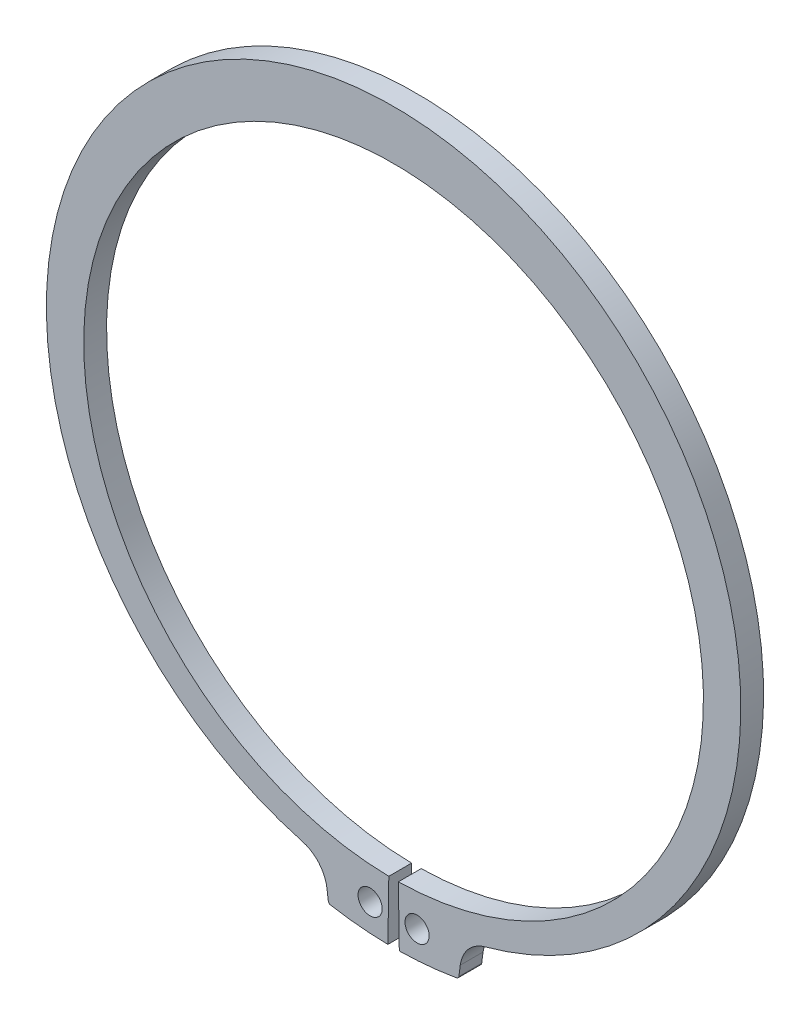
from build123d import *

# Parameters (mm, degrees)
BODYSKE_R  = 1.5875
BODY_DEPTH = 3


with BuildPart() as part:
    # BodySke → Body (new body)
    with BuildSketch(Plane.XY):
        with BuildLine():
            Line((0.629204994, -40.745142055), (0.75, -48.567409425))
            ThreePointArc((0.75, -48.567409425), (4.526051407, -48.36187152), (8.274668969, -47.86319684))
            ThreePointArc((8.274668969, -47.86319684), (8.484543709, -47.751692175), (8.587504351, -47.537496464))
            Line((8.587504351, -47.537496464), (8.767224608, -46.172385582))
            ThreePointArc((8.767224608, -46.172385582), (9.826006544, -43.828984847), (12.005380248, -42.464112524))
            ThreePointArc((12.005380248, -42.464112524), (0, 47.2524), (-12.005380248, -42.464112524))
            ThreePointArc((-12.005380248, -42.464112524), (-9.826006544, -43.828984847), (-8.767224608, -46.172385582))
            Line((-8.767224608, -46.172385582), (-8.587504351, -47.537496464))
            ThreePointArc((-8.587504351, -47.537496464), (-8.484543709, -47.751692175), (-8.274668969, -47.86319684))
            ThreePointArc((-8.274668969, -47.86319684), (-4.526051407, -48.36187152), (-0.75, -48.567409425))
            Line((-0.75, -48.567409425), (-0.629204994, -40.745142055))
            ThreePointArc((-0.629204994, -40.745142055), (0, 40.75), (0.629204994, -40.745142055))
        make_face()
        with Locations((3.0875, -44.893956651)):
            Circle(BODYSKE_R, mode=Mode.SUBTRACT)
        with Locations((-3.0875, -44.893956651)):
            Circle(BODYSKE_R, mode=Mode.SUBTRACT)
    extrude(amount=-BODY_DEPTH)


solid = part.part
